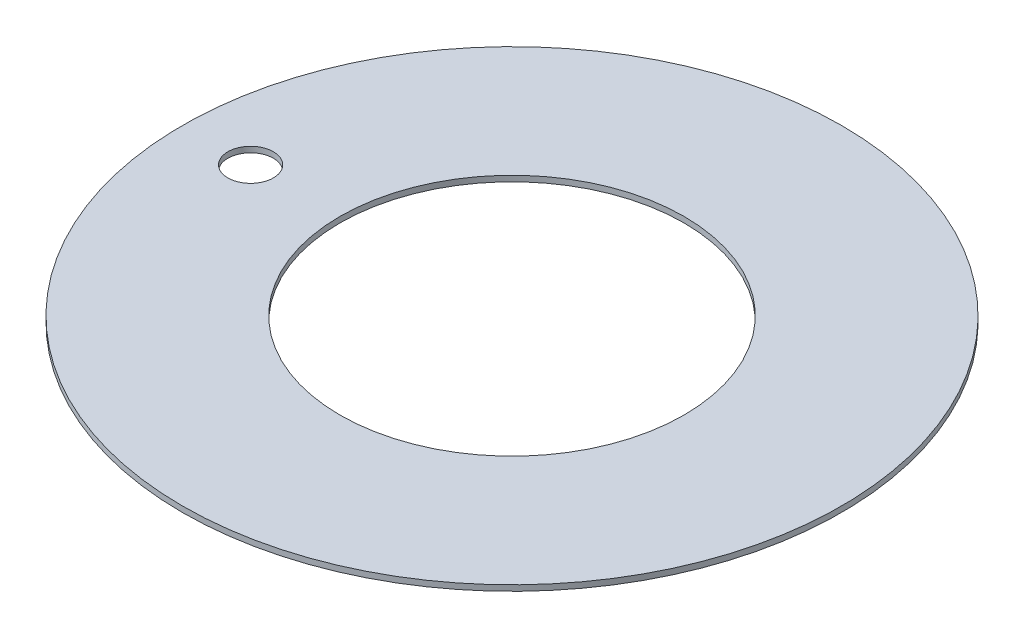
ISO-10303-21;
HEADER;
FILE_DESCRIPTION(('STEP AP214'),'2;1');
FILE_NAME('part.step','',(''),(''),'','','');
FILE_SCHEMA(('AUTOMOTIVE_DESIGN { 1 0 10303 214 1 1 1 1 }'));
ENDSEC;
DATA;
#1=APPLICATION_CONTEXT('core data for automotive mechanical design processes');
#2=APPLICATION_PROTOCOL_DEFINITION('international standard','automotive_design',2000,#1);
#3=PRODUCT_CONTEXT('',#1,'mechanical');
#4=PRODUCT('Part','Part','',(#3));
#5=PRODUCT_RELATED_PRODUCT_CATEGORY('part','',(#4));
#6=PRODUCT_DEFINITION_FORMATION('','',#4);
#7=PRODUCT_DEFINITION_CONTEXT('part definition',#1,'design');
#8=PRODUCT_DEFINITION('design','',#6,#7);
#9=PRODUCT_DEFINITION_SHAPE('','',#8);
#10=(LENGTH_UNIT() NAMED_UNIT(*) SI_UNIT(.MILLI.,.METRE.));
#11=(NAMED_UNIT(*) PLANE_ANGLE_UNIT() SI_UNIT($,.RADIAN.));
#12=(NAMED_UNIT(*) SI_UNIT($,.STERADIAN.) SOLID_ANGLE_UNIT());
#13=UNCERTAINTY_MEASURE_WITH_UNIT(LENGTH_MEASURE(1.E-05),#10,'distance_accuracy_value','');
#14=(GEOMETRIC_REPRESENTATION_CONTEXT(3) GLOBAL_UNCERTAINTY_ASSIGNED_CONTEXT((#13)) GLOBAL_UNIT_ASSIGNED_CONTEXT((#10,
#11,#12)) REPRESENTATION_CONTEXT('',''));
#15=CARTESIAN_POINT('',(0.,0.,0.));
#16=DIRECTION('',(0.,0.,1.));
#17=DIRECTION('',(1.,0.,0.));
#18=AXIS2_PLACEMENT_3D('',#15,#16,#17);
#19=CARTESIAN_POINT('',(0.,3.17499999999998,0.));
#20=DIRECTION('',(0.,1.,0.));
#21=DIRECTION('',(0.,0.,1.));
#22=AXIS2_PLACEMENT_3D('',#19,#20,#21);
#23=PLANE('',#22);
#24=CARTESIAN_POINT('',(-146.05,3.17499999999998,0.));
#25=DIRECTION('',(0.,1.,0.));
#26=DIRECTION('',(0.,0.,1.));
#27=AXIS2_PLACEMENT_3D('',#24,#25,#26);
#28=CIRCLE('',#27,12.7);
#29=CARTESIAN_POINT('',(-146.05,3.17499999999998,12.7));
#30=VERTEX_POINT('',#29);
#31=EDGE_CURVE('E51',#30,#30,#28,.T.);
#32=ORIENTED_EDGE('',*,*,#31,.F.);
#33=EDGE_LOOP('',(#32));
#34=FACE_BOUND('',#33,.T.);
#35=CARTESIAN_POINT('',(0.,3.17499999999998,0.));
#36=DIRECTION('',(0.,1.,0.));
#37=DIRECTION('',(0.,0.,1.));
#38=AXIS2_PLACEMENT_3D('',#35,#36,#37);
#39=CIRCLE('',#38,184.15);
#40=CARTESIAN_POINT('',(0.,3.17499999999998,184.15));
#41=VERTEX_POINT('',#40);
#42=EDGE_CURVE('E10',#41,#41,#39,.T.);
#43=ORIENTED_EDGE('',*,*,#42,.T.);
#44=EDGE_LOOP('',(#43));
#45=FACE_BOUND('',#44,.T.);
#46=CARTESIAN_POINT('',(0.,3.17499999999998,0.));
#47=DIRECTION('',(0.,1.,0.));
#48=DIRECTION('',(0.,0.,1.));
#49=AXIS2_PLACEMENT_3D('',#46,#47,#48);
#50=CIRCLE('',#49,96.139);
#51=CARTESIAN_POINT('',(0.,3.17499999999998,96.1390000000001));
#52=VERTEX_POINT('',#51);
#53=EDGE_CURVE('E39',#52,#52,#50,.T.);
#54=ORIENTED_EDGE('',*,*,#53,.F.);
#55=EDGE_LOOP('',(#54));
#56=FACE_BOUND('',#55,.T.);
#57=ADVANCED_FACE('F28',(#34,#45,#56),#23,.T.);
#58=CARTESIAN_POINT('',(0.,0.,0.));
#59=DIRECTION('',(0.,1.,0.));
#60=DIRECTION('',(0.,0.,1.));
#61=AXIS2_PLACEMENT_3D('',#58,#59,#60);
#62=PLANE('',#61);
#63=CARTESIAN_POINT('',(-146.05,0.,0.));
#64=DIRECTION('',(0.,1.,0.));
#65=DIRECTION('',(0.,0.,1.));
#66=AXIS2_PLACEMENT_3D('',#63,#64,#65);
#67=CIRCLE('',#66,12.7);
#68=CARTESIAN_POINT('',(-146.05,0.,12.7));
#69=VERTEX_POINT('',#68);
#70=EDGE_CURVE('E48',#69,#69,#67,.T.);
#71=ORIENTED_EDGE('',*,*,#70,.T.);
#72=EDGE_LOOP('',(#71));
#73=FACE_BOUND('',#72,.T.);
#74=CARTESIAN_POINT('',(0.,0.,0.));
#75=DIRECTION('',(0.,1.,0.));
#76=DIRECTION('',(0.,0.,1.));
#77=AXIS2_PLACEMENT_3D('',#74,#75,#76);
#78=CIRCLE('',#77,184.15);
#79=CARTESIAN_POINT('',(0.,0.,184.15));
#80=VERTEX_POINT('',#79);
#81=EDGE_CURVE('E35',#80,#80,#78,.T.);
#82=ORIENTED_EDGE('',*,*,#81,.F.);
#83=EDGE_LOOP('',(#82));
#84=FACE_BOUND('',#83,.T.);
#85=CARTESIAN_POINT('',(0.,0.,0.));
#86=DIRECTION('',(0.,1.,0.));
#87=DIRECTION('',(0.,0.,1.));
#88=AXIS2_PLACEMENT_3D('',#85,#86,#87);
#89=CIRCLE('',#88,96.139);
#90=CARTESIAN_POINT('',(0.,0.,96.1390000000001));
#91=VERTEX_POINT('',#90);
#92=EDGE_CURVE('E43',#91,#91,#89,.T.);
#93=ORIENTED_EDGE('',*,*,#92,.T.);
#94=EDGE_LOOP('',(#93));
#95=FACE_BOUND('',#94,.T.);
#96=ADVANCED_FACE('F58',(#73,#84,#95),#62,.F.);
#97=CARTESIAN_POINT('',(0.,3.17499999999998,0.));
#98=DIRECTION('',(0.,-1.,0.));
#99=DIRECTION('',(0.,0.,-1.));
#100=AXIS2_PLACEMENT_3D('',#97,#98,#99);
#101=CYLINDRICAL_SURFACE('',#100,184.15);
#102=ORIENTED_EDGE('',*,*,#42,.F.);
#103=EDGE_LOOP('',(#102));
#104=FACE_BOUND('',#103,.T.);
#105=ORIENTED_EDGE('',*,*,#81,.T.);
#106=EDGE_LOOP('',(#105));
#107=FACE_BOUND('',#106,.T.);
#108=ADVANCED_FACE('F30',(#104,#107),#101,.T.);
#109=CARTESIAN_POINT('',(0.,3.17499999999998,0.));
#110=DIRECTION('',(0.,-1.,0.));
#111=DIRECTION('',(0.,0.,-1.));
#112=AXIS2_PLACEMENT_3D('',#109,#110,#111);
#113=CYLINDRICAL_SURFACE('',#112,96.139);
#114=ORIENTED_EDGE('',*,*,#53,.T.);
#115=EDGE_LOOP('',(#114));
#116=FACE_BOUND('',#115,.T.);
#117=ORIENTED_EDGE('',*,*,#92,.F.);
#118=EDGE_LOOP('',(#117));
#119=FACE_BOUND('',#118,.T.);
#120=ADVANCED_FACE('F62',(#116,#119),#113,.F.);
#121=CARTESIAN_POINT('',(-146.05,0.,0.));
#122=DIRECTION('',(0.,1.,0.));
#123=DIRECTION('',(0.,0.,1.));
#124=AXIS2_PLACEMENT_3D('',#121,#122,#123);
#125=CYLINDRICAL_SURFACE('',#124,12.7);
#126=ORIENTED_EDGE('',*,*,#70,.F.);
#127=EDGE_LOOP('',(#126));
#128=FACE_BOUND('',#127,.T.);
#129=ORIENTED_EDGE('',*,*,#31,.T.);
#130=EDGE_LOOP('',(#129));
#131=FACE_BOUND('',#130,.T.);
#132=ADVANCED_FACE('F55',(#128,#131),#125,.F.);
#133=CLOSED_SHELL('',(#57,#96,#108,#120,#132));
#134=MANIFOLD_SOLID_BREP('B2',#133);
#135=ADVANCED_BREP_SHAPE_REPRESENTATION('',(#18,#134),#14);
#136=SHAPE_DEFINITION_REPRESENTATION(#9,#135);
ENDSEC;
END-ISO-10303-21;
